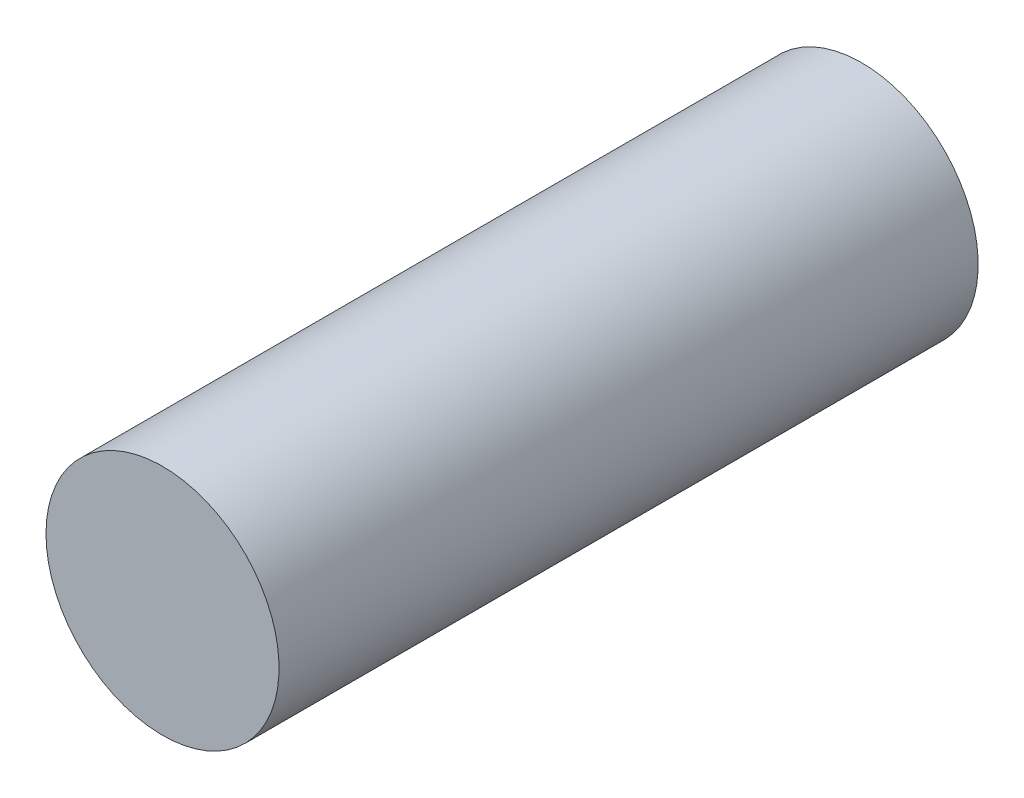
from build123d import *

# Parameters (mm, degrees)
EXTRUDE1_DEPTH      = 50.8
EXTRUDE1_DEPTH_BACK = 25.4
SKETCH1_R           = 12.7


with BuildPart() as part:
    # Sketch1 → Extrude1 (new, two sides: drawn at the far end of the back side and taken through both)
    with BuildSketch(Plane.XY.offset(-EXTRUDE1_DEPTH_BACK)):
        with Locations(Location((0, 0, 0), (0, 0, 180))):
            Circle(SKETCH1_R)
    extrude(amount=EXTRUDE1_DEPTH + EXTRUDE1_DEPTH_BACK)


solid = part.part
